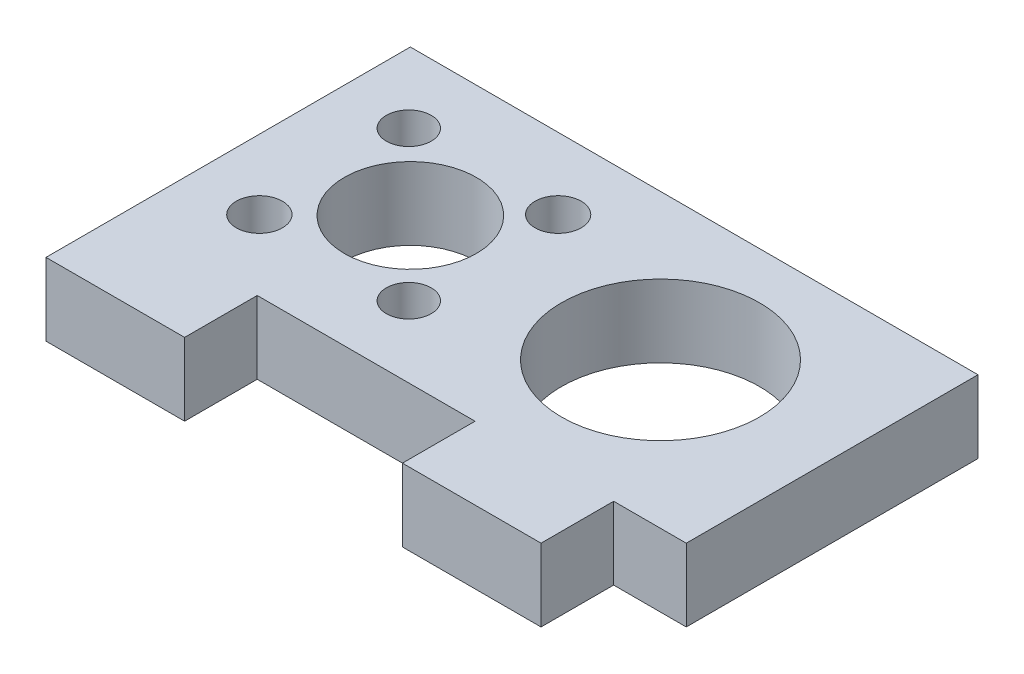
from build123d import *

# Parameters (mm, degrees)
SKETCH2_R           = 7.5
SKETCH2_R_2         = 5
SKETCH2_R_3         = 1.7
SKETCH2_R_4         = 1.75
BOSS_EXTRUDE1_DEPTH = 5.5


with BuildPart() as part:
    # Sketch2 → Boss-Extrude1 (new body)
    with BuildSketch(Plane(origin=(0, 0, 0), x_dir=(1, 0, 0), z_dir=(0, 1, 0))):
        Polygon((-37.381272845, 27.6), (0.118727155, 27.6), (5.618727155, 27.6), (5.618727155, 19.783530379), (5.618727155, 13.316469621), (5.618727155, 5.5), (0.118727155, 5.5), (0.118727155, 0), (0, 0), (-10.381272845, 0), (-10.381272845, 5.5), (-26.881272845, 5.5), (-26.881272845, 0), (-37.381272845, 0), align=None)
        with Locations(Location((-7.381272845, 16.55, 0), (0, 0, 270))):
            Circle(SKETCH2_R, mode=Mode.SUBTRACT)
        with Locations(Location((-26.331272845, 16.55, 0), (0, 0, 270))):
            Circle(SKETCH2_R_2, mode=Mode.SUBTRACT)
        with Locations(Location((-32.109636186, 22.209924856, 0), (0, 0, 270))):
            Circle(SKETCH2_R_3, mode=Mode.SUBTRACT)
        with Locations(Location((-20.793145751, 22.206854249, 0), (0, 0, 270))):
            Circle(SKETCH2_R_4, mode=Mode.SUBTRACT)
        with Locations(Location((-32.109560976, 10.890166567, 0), (0, 0, 270))):
            Circle(SKETCH2_R_4, mode=Mode.SUBTRACT)
        with Locations(Location((-20.793145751, 10.893145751, 0), (0, 0, 270))):
            Circle(SKETCH2_R_3, mode=Mode.SUBTRACT)
    extrude(amount=BOSS_EXTRUDE1_DEPTH)


solid = part.part
